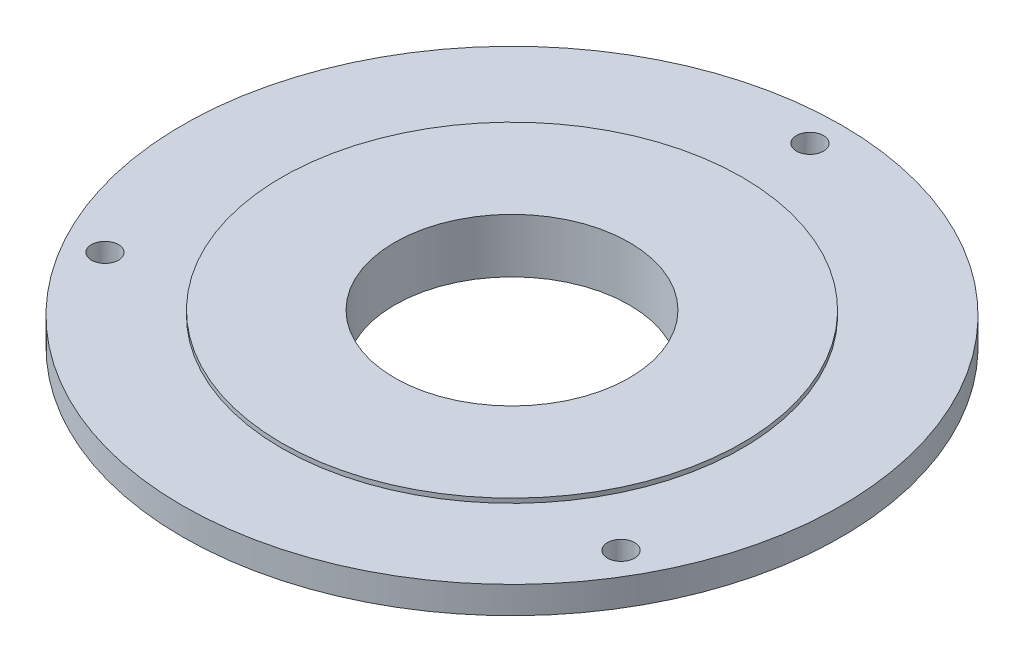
from build123d import *

# Parameters (mm, degrees)
SCHIZZO2_R               = 1.5
TAGLIO_ESTRUSIONE1_DEPTH = 52.910981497


with BuildPart() as part:
    # Schizzo1 → Rivoluzione1 (revolve)
    with BuildSketch(Plane.XY, mode=Mode.PRIVATE) as rivoluzione1_sk:
        Polygon((36.5, 37.385931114), (36.5, 34.385931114), (14.25, 34.385931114), (14.25, 31.885931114), (13, 31.885931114), (13, 37.885931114), (25.5, 37.885931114), (25.5, 37.385931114), align=None)
    revolve(rivoluzione1_sk.sketch.rotate(Axis((0, 0, 0), (0, 1, 0)), 90), axis=Axis((0, 0, 0), (0, 1, 0)))

    # Schizzo2 → Taglio-Estrusione1 (cut, through all)
    with BuildSketch(Plane(origin=(0, 37.385931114, 0), x_dir=(1, 0, 0), z_dir=(0, 1, 0))):
        with Locations(Location((0, 33, 0), (0, 0, 270))):
            Circle(SCHIZZO2_R)
        with Locations(Location((28.578838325, -16.5, 0), (0, 0, 270))):
            Circle(SCHIZZO2_R)
        with Locations(Location((-28.578838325, -16.5, 0), (0, 0, 270))):
            Circle(SCHIZZO2_R)
    extrude(amount=-TAGLIO_ESTRUSIONE1_DEPTH, mode=Mode.SUBTRACT)


solid = part.part
